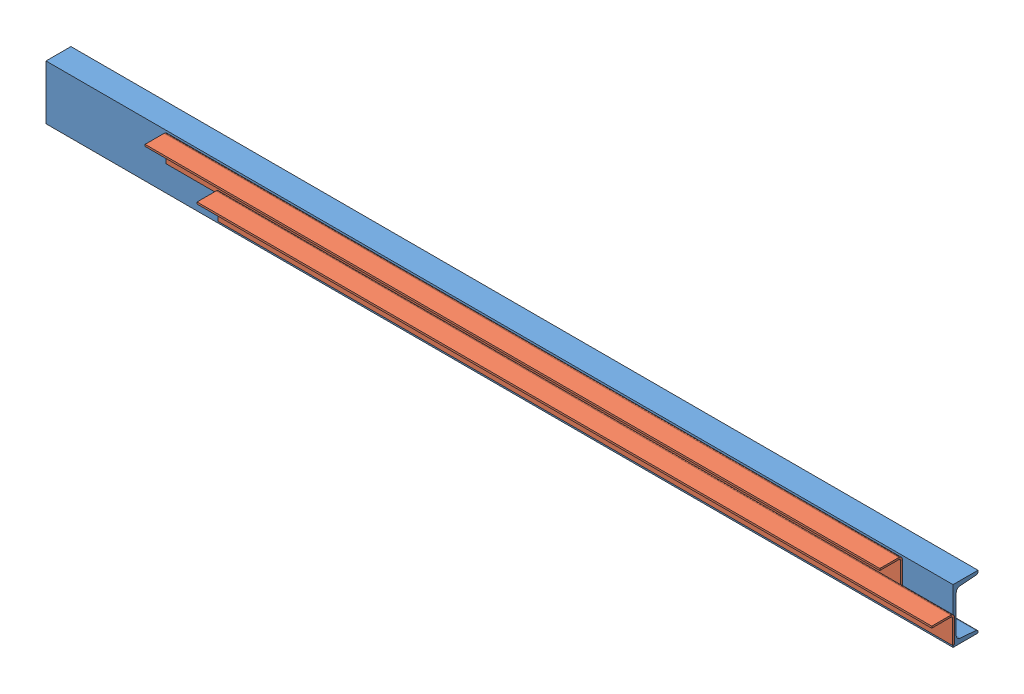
SolidWorks assembly Złożenie1.SLDASM, configuration Domyślna (file format 10000). Lengths in mm.
Overall size (2003.04 120 105).
3 component instances, 2 part files, 5 mates.
Components (placement in the parent):
- C120-1: C120.SLDPRT [Domyślna<Obrobiona>] at origin size (2000 120 55)
- Lzg_60x50x4_401-1: Lzg_60x50x4_401.SLDPRT [Domyślna<Obrobiona>] at (268.4661 0 0) x (-1 0 0) z (0 0 -1) size (1620 60 50)
- Lzg_60x50x4_401-2: Lzg_60x50x4_401.SLDPRT [Domyślna<Obrobiona>] at (383.043 -52.7744 0) x (-1 0 0) z (0 0 -1) size (1620 60 50)
Mates (geometry in assembly coordinates):
- Wspólnie1: coincident anti-aligned: plane of C120-1 through (2000 -120 0) normal (0 0 1); plane of Lzg_60x50x4_401-1 through (1888.4661 0 0) normal (0 0 -1)
- Wspólnie2: coincident aligned: plane of C120-1 through (2000 0 -55) normal (0 1 0); plane of Lzg_60x50x4_401-1 through (1888.4661 0 0) normal (0 1 0)
- Wspólnie3: coincident anti-aligned: plane of C120-1 through (2000 -120 0) normal (0 0 1); plane of Lzg_60x50x4_401-2 through (2003.043 -52.7744 0) normal (0 0 -1)
- Wspólnie4: coincident anti-aligned: plane of C120-1 through (2000 -120 0) normal (0 0 1); plane of ? through (1271.1385 120.1301 0) normal (0 0 -1)
- Równolegle1: parallel aligned: plane of C120-1 through (2000 0 -55) normal (0 1 0); plane of Lzg_60x50x4_401-2 through (2003.043 -52.7744 0) normal (0 1 0)
